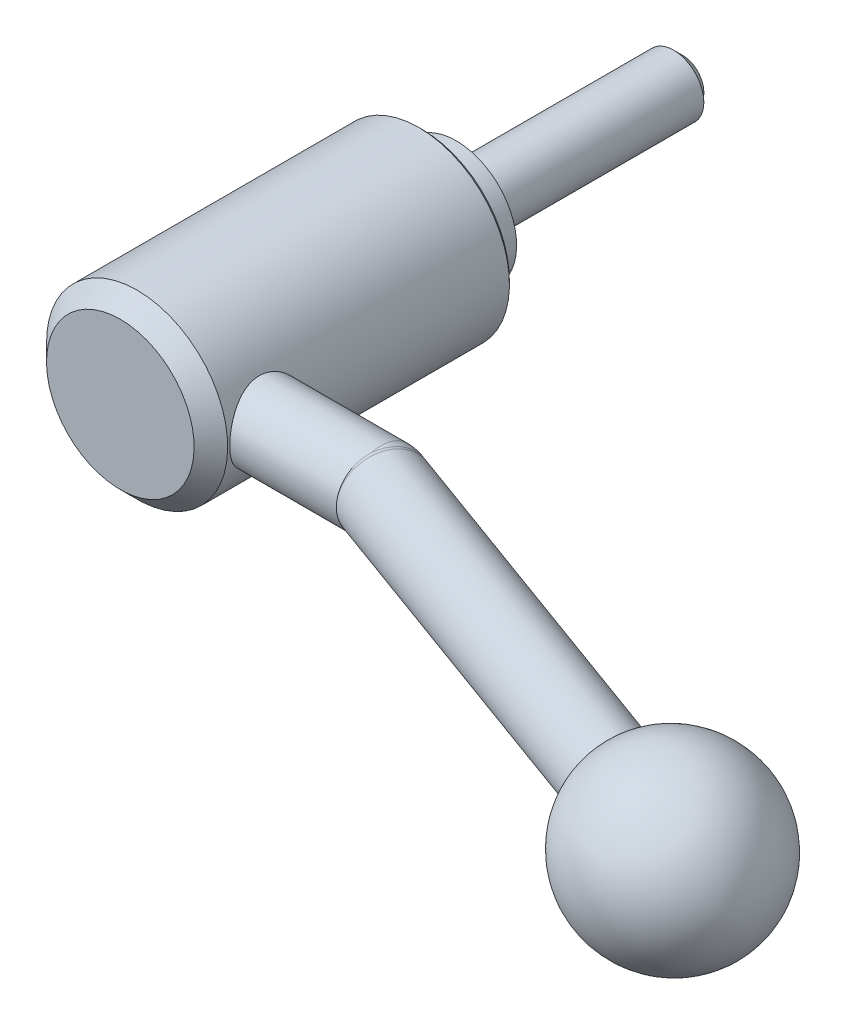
ISO-10303-21;
HEADER;
FILE_DESCRIPTION(('STEP AP214'),'2;1');
FILE_NAME('part.step','',(''),(''),'','','');
FILE_SCHEMA(('AUTOMOTIVE_DESIGN { 1 0 10303 214 1 1 1 1 }'));
ENDSEC;
DATA;
#1=APPLICATION_CONTEXT('core data for automotive mechanical design processes');
#2=APPLICATION_PROTOCOL_DEFINITION('international standard','automotive_design',2000,#1);
#3=PRODUCT_CONTEXT('',#1,'mechanical');
#4=PRODUCT('Part','Part','',(#3));
#5=PRODUCT_RELATED_PRODUCT_CATEGORY('part','',(#4));
#6=PRODUCT_DEFINITION_FORMATION('','',#4);
#7=PRODUCT_DEFINITION_CONTEXT('part definition',#1,'design');
#8=PRODUCT_DEFINITION('design','',#6,#7);
#9=PRODUCT_DEFINITION_SHAPE('','',#8);
#10=(LENGTH_UNIT() NAMED_UNIT(*) SI_UNIT(.MILLI.,.METRE.));
#11=(NAMED_UNIT(*) PLANE_ANGLE_UNIT() SI_UNIT($,.RADIAN.));
#12=(NAMED_UNIT(*) SI_UNIT($,.STERADIAN.) SOLID_ANGLE_UNIT());
#13=UNCERTAINTY_MEASURE_WITH_UNIT(LENGTH_MEASURE(1.E-05),#10,'distance_accuracy_value','');
#14=(GEOMETRIC_REPRESENTATION_CONTEXT(3) GLOBAL_UNCERTAINTY_ASSIGNED_CONTEXT((#13)) GLOBAL_UNIT_ASSIGNED_CONTEXT((#10,
#11,#12)) REPRESENTATION_CONTEXT('',''));
#15=CARTESIAN_POINT('',(0.,0.,0.));
#16=DIRECTION('',(0.,0.,1.));
#17=DIRECTION('',(1.,0.,0.));
#18=AXIS2_PLACEMENT_3D('',#15,#16,#17);
#19=CARTESIAN_POINT('',(0.,0.,-20.));
#20=DIRECTION('',(0.,0.,-1.));
#21=DIRECTION('',(0.,1.,0.));
#22=AXIS2_PLACEMENT_3D('',#19,#20,#21);
#23=CYLINDRICAL_SURFACE('',#22,12.);
#24=CARTESIAN_POINT('',(0.,0.,4.95));
#25=DIRECTION('',(0.,0.,-1.));
#26=DIRECTION('',(0.,1.,0.));
#27=AXIS2_PLACEMENT_3D('',#24,#25,#26);
#28=CIRCLE('',#27,12.);
#29=CARTESIAN_POINT('',(0.,12.,4.95));
#30=VERTEX_POINT('',#29);
#31=EDGE_CURVE('E142',#30,#30,#28,.T.);
#32=ORIENTED_EDGE('',*,*,#31,.F.);
#33=EDGE_LOOP('',(#32));
#34=FACE_BOUND('',#33,.T.);
#35=CARTESIAN_POINT('',(10.9087121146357,5.,37.));
#36=CARTESIAN_POINT('',(10.9087130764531,4.99999907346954,37.1334013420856));
#37=CARTESIAN_POINT('',(10.9111675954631,4.99465346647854,37.266850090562));
#38=CARTESIAN_POINT('',(10.9209052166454,4.97332510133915,37.5327768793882));
#39=CARTESIAN_POINT('',(10.9281914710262,4.95733539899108,37.6652542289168));
#40=CARTESIAN_POINT('',(10.94736464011,4.91485001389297,37.928469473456));
#41=CARTESIAN_POINT('',(10.9592613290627,4.88833200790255,38.0592030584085));
#42=CARTESIAN_POINT('',(10.9872633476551,4.82506361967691,38.3177583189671));
#43=CARTESIAN_POINT('',(11.0033704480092,4.7883089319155,38.4455787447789));
#44=CARTESIAN_POINT('',(11.0391992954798,4.7051161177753,38.6968536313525));
#45=CARTESIAN_POINT('',(11.0589043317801,4.65872262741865,38.8203252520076));
#46=CARTESIAN_POINT('',(11.1013893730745,4.5565572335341,39.062794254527));
#47=CARTESIAN_POINT('',(11.1241705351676,4.5007817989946,39.1817899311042));
#48=CARTESIAN_POINT('',(11.1961478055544,4.3200790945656,39.5308988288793));
#49=CARTESIAN_POINT('',(11.2490254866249,4.18166963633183,39.7534507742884));
#50=CARTESIAN_POINT('',(11.3622340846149,3.86388960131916,40.185337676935));
#51=CARTESIAN_POINT('',(11.4228172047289,3.68264836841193,40.3932181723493));
#52=CARTESIAN_POINT('',(11.5425773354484,3.28805127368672,40.7768129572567));
#53=CARTESIAN_POINT('',(11.6017537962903,3.07468308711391,40.9525148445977));
#54=CARTESIAN_POINT('',(11.6861172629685,2.72939811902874,41.1918033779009));
#55=CARTESIAN_POINT('',(11.7140370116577,2.60726265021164,41.2688525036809));
#56=CARTESIAN_POINT('',(11.7670757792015,2.35633907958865,41.4123143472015));
#57=CARTESIAN_POINT('',(11.7921959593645,2.22755376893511,41.4787314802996));
#58=CARTESIAN_POINT('',(11.838917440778,1.96416180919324,41.6003389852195));
#59=CARTESIAN_POINT('',(11.8605184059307,1.82955460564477,41.6555282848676));
#60=CARTESIAN_POINT('',(11.8995529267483,1.55556138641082,41.7540939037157));
#61=CARTESIAN_POINT('',(11.9169885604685,1.41617779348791,41.7974761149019));
#62=CARTESIAN_POINT('',(11.9463943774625,1.14097065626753,41.8700493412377));
#63=CARTESIAN_POINT('',(11.9586002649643,1.00533485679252,41.8998574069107));
#64=CARTESIAN_POINT('',(11.978450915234,0.731783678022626,41.9481078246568));
#65=CARTESIAN_POINT('',(11.9860977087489,0.593869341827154,41.9665552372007));
#66=CARTESIAN_POINT('',(11.9966178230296,0.316820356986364,41.9918906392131));
#67=CARTESIAN_POINT('',(11.9994918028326,0.177685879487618,41.998780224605));
#68=CARTESIAN_POINT('',(12.0003846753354,-0.100685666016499,42.0009233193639));
#69=CARTESIAN_POINT('',(11.9984037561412,-0.239922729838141,41.9961772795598));
#70=CARTESIAN_POINT('',(11.9899136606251,-0.508875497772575,41.9757519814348));
#71=CARTESIAN_POINT('',(11.9836886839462,-0.638652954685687,41.9607587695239));
#72=CARTESIAN_POINT('',(11.9671679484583,-0.896425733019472,41.9207154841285));
#73=CARTESIAN_POINT('',(11.9568708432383,-1.02442045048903,41.8956620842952));
#74=CARTESIAN_POINT('',(11.9324642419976,-1.27768058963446,41.8357474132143));
#75=CARTESIAN_POINT('',(11.9183560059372,-1.40294689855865,41.8008893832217));
#76=CARTESIAN_POINT('',(11.8866740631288,-1.65000960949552,41.7216867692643));
#77=CARTESIAN_POINT('',(11.8690990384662,-1.77180467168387,41.6773385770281));
#78=CARTESIAN_POINT('',(11.8112061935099,-2.1344060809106,41.5291317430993));
#79=CARTESIAN_POINT('',(11.7660875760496,-2.36878813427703,41.4109765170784));
#80=CARTESIAN_POINT('',(11.6674248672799,-2.81488765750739,41.1406025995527));
#81=CARTESIAN_POINT('',(11.6138778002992,-3.02659707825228,40.9883718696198));
#82=CARTESIAN_POINT('',(11.4992708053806,-3.4373466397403,40.6416848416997));
#83=CARTESIAN_POINT('',(11.4379473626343,-3.6344418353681,40.4450085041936));
#84=CARTESIAN_POINT('',(11.317506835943,-3.9937495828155,40.0211105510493));
#85=CARTESIAN_POINT('',(11.2583906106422,-4.15594867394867,39.7938772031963));
#86=CARTESIAN_POINT('',(11.1754830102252,-4.37204843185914,39.4302315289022));
#87=CARTESIAN_POINT('',(11.1484199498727,-4.44042007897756,39.3029580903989));
#88=CARTESIAN_POINT('',(11.0975376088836,-4.5660982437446,39.0424564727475));
#89=CARTESIAN_POINT('',(11.0737170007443,-4.62340929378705,38.9092307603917));
#90=CARTESIAN_POINT('',(11.0301558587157,-4.72639308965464,38.6377673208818));
#91=CARTESIAN_POINT('',(11.010413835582,-4.77207008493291,38.4995314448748));
#92=CARTESIAN_POINT('',(10.9757324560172,-4.85130620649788,38.219039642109));
#93=CARTESIAN_POINT('',(10.9607926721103,-4.88486641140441,38.0767840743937));
#94=CARTESIAN_POINT('',(10.9370969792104,-4.93768074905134,37.7987576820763));
#95=CARTESIAN_POINT('',(10.9280027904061,-4.95772169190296,37.6631648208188));
#96=CARTESIAN_POINT('',(10.9148523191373,-4.9866073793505,37.3905520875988));
#97=CARTESIAN_POINT('',(10.9107956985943,-4.99545287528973,37.2535323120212));
#98=CARTESIAN_POINT('',(10.9078699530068,-5.00183821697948,36.9792139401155));
#99=CARTESIAN_POINT('',(10.9089993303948,-4.9993813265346,36.8419154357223));
#100=CARTESIAN_POINT('',(10.9163998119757,-4.98320111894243,36.5681288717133));
#101=CARTESIAN_POINT('',(10.9226707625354,-4.96947813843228,36.4316407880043));
#102=CARTESIAN_POINT('',(10.939564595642,-4.93217158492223,36.1692842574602));
#103=CARTESIAN_POINT('',(10.9498816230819,-4.90927900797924,36.0432974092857));
#104=CARTESIAN_POINT('',(10.9744912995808,-4.85401305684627,35.7938045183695));
#105=CARTESIAN_POINT('',(10.9887852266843,-4.82163663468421,35.6702992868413));
#106=CARTESIAN_POINT('',(11.0370194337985,-4.71071065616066,35.3047320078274));
#107=CARTESIAN_POINT('',(11.0763259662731,-4.6183356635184,35.0674195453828));
#108=CARTESIAN_POINT('',(11.1668340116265,-4.39509042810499,34.6014982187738));
#109=CARTESIAN_POINT('',(11.2184687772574,-4.26275559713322,34.3736835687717));
#110=CARTESIAN_POINT('',(11.3271978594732,-3.9648148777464,33.9423843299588));
#111=CARTESIAN_POINT('',(11.3842945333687,-3.79919458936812,33.7389103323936));
#112=CARTESIAN_POINT('',(11.5031524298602,-3.42333828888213,33.344771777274));
#113=CARTESIAN_POINT('',(11.5649149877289,-3.21056780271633,33.1564985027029));
#114=CARTESIAN_POINT('',(11.652539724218,-2.86918502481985,32.9026870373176));
#115=CARTESIAN_POINT('',(11.6809270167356,-2.75160882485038,32.8228101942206));
#116=CARTESIAN_POINT('',(11.7352796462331,-2.50969002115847,32.6731475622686));
#117=CARTESIAN_POINT('',(11.761246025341,-2.38535036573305,32.6033574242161));
#118=CARTESIAN_POINT('',(11.8101156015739,-2.13027929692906,32.4742500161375));
#119=CARTESIAN_POINT('',(11.8330091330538,-1.99952940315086,32.4149656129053));
#120=CARTESIAN_POINT('',(11.8749794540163,-1.73293321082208,32.3077113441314));
#121=CARTESIAN_POINT('',(11.8940578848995,-1.59708913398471,32.2597366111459));
#122=CARTESIAN_POINT('',(11.9278439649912,-1.32129951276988,32.1755883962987));
#123=CARTESIAN_POINT('',(11.9425527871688,-1.18135508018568,32.1394117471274));
#124=CARTESIAN_POINT('',(11.9671605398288,-0.89845467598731,32.0792595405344));
#125=CARTESIAN_POINT('',(11.9770598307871,-0.75549893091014,32.0552830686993));
#126=CARTESIAN_POINT('',(11.9912289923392,-0.477883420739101,32.021064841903));
#127=CARTESIAN_POINT('',(11.9958449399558,-0.343344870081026,32.0099778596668));
#128=CARTESIAN_POINT('',(12.0005316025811,-0.073683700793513,31.9987215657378));
#129=CARTESIAN_POINT('',(12.0006007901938,0.0614390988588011,31.9985559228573));
#130=CARTESIAN_POINT('',(11.9961887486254,0.331106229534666,32.0091516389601));
#131=CARTESIAN_POINT('',(11.9917099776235,0.465650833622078,32.0199070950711));
#132=CARTESIAN_POINT('',(11.9783256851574,0.733261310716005,32.0522225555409));
#133=CARTESIAN_POINT('',(11.9694185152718,0.866326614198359,32.0737865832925));
#134=CARTESIAN_POINT('',(11.9478093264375,1.12521434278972,32.1265303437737));
#135=CARTESIAN_POINT('',(11.9352551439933,1.25112522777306,32.1573367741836));
#136=CARTESIAN_POINT('',(11.9065633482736,1.49981842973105,32.2284909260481));
#137=CARTESIAN_POINT('',(11.8904244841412,1.62259963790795,32.2688419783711));
#138=CARTESIAN_POINT('',(11.8371898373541,1.98503132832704,32.403699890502));
#139=CARTESIAN_POINT('',(11.7952573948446,2.21898154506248,32.5120551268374));
#140=CARTESIAN_POINT('',(11.700229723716,2.67613896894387,32.7679713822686));
#141=CARTESIAN_POINT('',(11.6467156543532,2.8983828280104,32.9170829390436));
#142=CARTESIAN_POINT('',(11.5348651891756,3.31565850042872,33.248014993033));
#143=CARTESIAN_POINT('',(11.4765270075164,3.51068016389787,33.4298476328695));
#144=CARTESIAN_POINT('',(11.3565857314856,3.88182487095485,33.835823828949));
#145=CARTESIAN_POINT('',(11.2950305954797,4.05575892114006,34.0620045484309));
#146=CARTESIAN_POINT('',(11.2086213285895,4.28644220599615,34.4218577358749));
#147=CARTESIAN_POINT('',(11.1807840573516,4.35834922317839,34.5453544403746));
#148=CARTESIAN_POINT('',(11.1279493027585,4.49153302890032,34.7985115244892));
#149=CARTESIAN_POINT('',(11.1029505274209,4.55281466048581,34.9281690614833));
#150=CARTESIAN_POINT('',(11.0567342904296,4.66392927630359,35.1921877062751));
#151=CARTESIAN_POINT('',(11.0354990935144,4.7138162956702,35.3265229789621));
#152=CARTESIAN_POINT('',(10.9974167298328,4.80199267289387,35.599492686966));
#153=CARTESIAN_POINT('',(10.9805674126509,4.84028771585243,35.7381249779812));
#154=CARTESIAN_POINT('',(10.9519122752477,4.90477948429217,36.0182918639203));
#155=CARTESIAN_POINT('',(10.9400931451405,4.93100815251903,36.1598177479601));
#156=CARTESIAN_POINT('',(10.9219030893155,4.97116941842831,36.4448760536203));
#157=CARTESIAN_POINT('',(10.9155279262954,4.98511157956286,36.5884068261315));
#158=CARTESIAN_POINT('',(10.9109028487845,4.99521783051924,36.7768518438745));
#159=CARTESIAN_POINT('',(10.9100818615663,4.99701063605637,36.8214567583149));
#160=CARTESIAN_POINT('',(10.9089863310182,4.99940188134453,36.9107060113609));
#161=CARTESIAN_POINT('',(10.9087117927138,5.00000031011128,36.9553503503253));
#162=CARTESIAN_POINT('',(10.9087121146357,5.,37.));
#163=B_SPLINE_CURVE_WITH_KNOTS('',3,(#35,#36,#37,#38,#39,#40,#41,#42,#43,#44,#45,#46,#47,#48,
#49,#50,#51,#52,#53,#54,#55,#56,#57,#58,#59,#60,#61,#62,#63,#64,#65,#66,#67,#68,#69,#70,#71,#72,
#73,#74,#75,#76,#77,#78,#79,#80,#81,#82,#83,#84,#85,#86,#87,#88,#89,#90,#91,#92,#93,#94,#95,#96,
#97,#98,#99,#100,#101,#102,#103,#104,#105,#106,#107,#108,#109,#110,#111,#112,#113,#114,#115,
#116,#117,#118,#119,#120,#121,#122,#123,#124,#125,#126,#127,#128,#129,#130,#131,#132,#133,#134,
#135,#136,#137,#138,#139,#140,#141,#142,#143,#144,#145,#146,#147,#148,#149,#150,#151,#152,#153,
#154,#155,#156,#157,#158,#159,#160,#161,#162),.UNSPECIFIED.,.T.,.F.,(4,2,2,2,2,2,2,2,2,2,2,2,2,
2,2,2,2,2,2,2,2,2,2,2,2,2,2,2,2,2,2,2,2,2,2,2,2,2,2,2,2,2,2,2,2,2,2,2,2,2,2,2,2,2,2,2,2,2,2,2,2,
2,2,4),(0.,0.400157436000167,0.800576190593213,1.20184852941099,1.60328989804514,
2.00291210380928,2.40268505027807,3.20123019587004,4.04483609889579,4.88876646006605,
5.32954710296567,5.77014421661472,6.21078338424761,6.65120225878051,7.06888225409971,
7.48637606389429,7.90381222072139,8.32123220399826,8.71313663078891,9.10517074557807,
9.49707541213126,9.88912935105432,10.6843842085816,11.4799204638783,12.3315328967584,
13.1834732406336,13.6239634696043,14.064272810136,14.5044210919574,14.9445301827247,
15.3560893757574,15.7676209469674,16.1790336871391,16.5904341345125,16.9753736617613,
17.3604370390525,18.129966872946,18.9320860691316,19.7345530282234,20.6023475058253,
21.0367677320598,21.4710000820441,21.9065678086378,22.3419477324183,22.7772106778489,
23.2124409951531,23.6171514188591,24.0219977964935,24.4266254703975,24.8314038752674,
25.2216396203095,25.6120117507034,26.3921129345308,27.2074696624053,28.0231295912,
28.8942922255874,29.3306260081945,29.7667603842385,30.2007814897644,30.6345893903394,
31.067242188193,31.4995579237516,31.6334900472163,31.7674234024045),.UNSPECIFIED.);
#164=CARTESIAN_POINT('',(10.9087121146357,5.,37.));
#165=VERTEX_POINT('',#164);
#166=EDGE_CURVE('E76',#165,#165,#163,.T.);
#167=ORIENTED_EDGE('',*,*,#166,.F.);
#168=EDGE_LOOP('',(#167));
#169=FACE_BOUND('',#168,.T.);
#170=CARTESIAN_POINT('',(0.,0.,42.275));
#171=DIRECTION('',(0.,0.,-1.));
#172=DIRECTION('',(0.,1.,0.));
#173=AXIS2_PLACEMENT_3D('',#170,#171,#172);
#174=CIRCLE('',#173,12.);
#175=CARTESIAN_POINT('',(0.,12.,42.275));
#176=VERTEX_POINT('',#175);
#177=EDGE_CURVE('E144',#176,#176,#174,.T.);
#178=ORIENTED_EDGE('',*,*,#177,.T.);
#179=EDGE_LOOP('',(#178));
#180=FACE_BOUND('',#179,.T.);
#181=ADVANCED_FACE('F14',(#34,#169,#180),#23,.T.);
#182=CARTESIAN_POINT('',(0.,0.,44.5));
#183=DIRECTION('',(0.,0.,-1.));
#184=DIRECTION('',(0.,1.,0.));
#185=AXIS2_PLACEMENT_3D('',#182,#183,#184);
#186=PLANE('',#185);
#187=CARTESIAN_POINT('',(0.,0.,44.5));
#188=DIRECTION('',(0.,0.,-1.));
#189=DIRECTION('',(0.,1.,0.));
#190=AXIS2_PLACEMENT_3D('',#187,#188,#189);
#191=CIRCLE('',#190,9.775);
#192=CARTESIAN_POINT('',(0.,9.775,44.5));
#193=VERTEX_POINT('',#192);
#194=EDGE_CURVE('E84',#193,#193,#191,.T.);
#195=ORIENTED_EDGE('',*,*,#194,.F.);
#196=EDGE_LOOP('',(#195));
#197=FACE_BOUND('',#196,.T.);
#198=ADVANCED_FACE('F60',(#197),#186,.F.);
#199=CARTESIAN_POINT('',(0.,0.,44.5));
#200=DIRECTION('',(0.,0.,-1.));
#201=DIRECTION('',(0.,1.,0.));
#202=AXIS2_PLACEMENT_3D('',#199,#200,#201);
#203=CONICAL_SURFACE('',#202,9.775,0.785398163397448);
#204=ORIENTED_EDGE('',*,*,#177,.F.);
#205=EDGE_LOOP('',(#204));
#206=FACE_BOUND('',#205,.T.);
#207=ORIENTED_EDGE('',*,*,#194,.T.);
#208=EDGE_LOOP('',(#207));
#209=FACE_BOUND('',#208,.T.);
#210=ADVANCED_FACE('F66',(#206,#209),#203,.T.);
#211=CARTESIAN_POINT('',(0.,0.,4.95));
#212=DIRECTION('',(0.,0.,1.));
#213=DIRECTION('',(0.,-1.,0.));
#214=AXIS2_PLACEMENT_3D('',#211,#212,#213);
#215=CONICAL_SURFACE('',#214,12.,0.785398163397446);
#216=CARTESIAN_POINT('',(0.,0.,4.5));
#217=DIRECTION('',(0.,0.,-1.));
#218=DIRECTION('',(0.,1.,0.));
#219=AXIS2_PLACEMENT_3D('',#216,#217,#218);
#220=CIRCLE('',#219,11.55);
#221=CARTESIAN_POINT('',(0.,11.55,4.5));
#222=VERTEX_POINT('',#221);
#223=EDGE_CURVE('E139',#222,#222,#220,.T.);
#224=ORIENTED_EDGE('',*,*,#223,.F.);
#225=EDGE_LOOP('',(#224));
#226=FACE_BOUND('',#225,.T.);
#227=ORIENTED_EDGE('',*,*,#31,.T.);
#228=EDGE_LOOP('',(#227));
#229=FACE_BOUND('',#228,.T.);
#230=ADVANCED_FACE('F73',(#226,#229),#215,.T.);
#231=CARTESIAN_POINT('',(11.55,0.,4.5));
#232=DIRECTION('',(0.,0.,1.));
#233=DIRECTION('',(0.,-1.,0.));
#234=AXIS2_PLACEMENT_3D('',#231,#232,#233);
#235=PLANE('',#234);
#236=CARTESIAN_POINT('',(0.,0.,4.5));
#237=DIRECTION('',(0.,0.,-1.));
#238=DIRECTION('',(0.,1.,0.));
#239=AXIS2_PLACEMENT_3D('',#236,#237,#238);
#240=CIRCLE('',#239,8.);
#241=CARTESIAN_POINT('',(0.,8.,4.5));
#242=VERTEX_POINT('',#241);
#243=EDGE_CURVE('E134',#242,#242,#240,.T.);
#244=ORIENTED_EDGE('',*,*,#243,.F.);
#245=EDGE_LOOP('',(#244));
#246=FACE_BOUND('',#245,.T.);
#247=ORIENTED_EDGE('',*,*,#223,.T.);
#248=EDGE_LOOP('',(#247));
#249=FACE_BOUND('',#248,.T.);
#250=ADVANCED_FACE('F156',(#246,#249),#235,.F.);
#251=CARTESIAN_POINT('',(0.,0.,-20.));
#252=DIRECTION('',(0.,0.,-1.));
#253=DIRECTION('',(0.,1.,0.));
#254=AXIS2_PLACEMENT_3D('',#251,#252,#253);
#255=CYLINDRICAL_SURFACE('',#254,8.);
#256=CARTESIAN_POINT('',(0.,0.,0.));
#257=DIRECTION('',(0.,0.,-1.));
#258=DIRECTION('',(0.,1.,0.));
#259=AXIS2_PLACEMENT_3D('',#256,#257,#258);
#260=CIRCLE('',#259,8.);
#261=CARTESIAN_POINT('',(0.,8.,0.));
#262=VERTEX_POINT('',#261);
#263=EDGE_CURVE('E130',#262,#262,#260,.T.);
#264=ORIENTED_EDGE('',*,*,#263,.F.);
#265=EDGE_LOOP('',(#264));
#266=FACE_BOUND('',#265,.T.);
#267=ORIENTED_EDGE('',*,*,#243,.T.);
#268=EDGE_LOOP('',(#267));
#269=FACE_BOUND('',#268,.T.);
#270=ADVANCED_FACE('F161',(#266,#269),#255,.T.);
#271=CARTESIAN_POINT('',(8.,0.,0.));
#272=DIRECTION('',(0.,0.,1.));
#273=DIRECTION('',(0.,-1.,0.));
#274=AXIS2_PLACEMENT_3D('',#271,#272,#273);
#275=PLANE('',#274);
#276=CARTESIAN_POINT('',(0.,0.,0.));
#277=DIRECTION('',(0.,0.,-1.));
#278=DIRECTION('',(0.,1.,0.));
#279=AXIS2_PLACEMENT_3D('',#276,#277,#278);
#280=CIRCLE('',#279,4.);
#281=CARTESIAN_POINT('',(0.,4.,0.));
#282=VERTEX_POINT('',#281);
#283=EDGE_CURVE('E128',#282,#282,#280,.T.);
#284=ORIENTED_EDGE('',*,*,#283,.F.);
#285=EDGE_LOOP('',(#284));
#286=FACE_BOUND('',#285,.T.);
#287=ORIENTED_EDGE('',*,*,#263,.T.);
#288=EDGE_LOOP('',(#287));
#289=FACE_BOUND('',#288,.T.);
#290=ADVANCED_FACE('F169',(#286,#289),#275,.F.);
#291=CARTESIAN_POINT('',(0.,0.,-20.));
#292=DIRECTION('',(0.,0.,-1.));
#293=DIRECTION('',(0.,1.,0.));
#294=AXIS2_PLACEMENT_3D('',#291,#292,#293);
#295=CYLINDRICAL_SURFACE('',#294,4.);
#296=CARTESIAN_POINT('',(0.,0.,-28.8));
#297=DIRECTION('',(0.,0.,-1.));
#298=DIRECTION('',(0.,1.,0.));
#299=AXIS2_PLACEMENT_3D('',#296,#297,#298);
#300=CIRCLE('',#299,4.);
#301=CARTESIAN_POINT('',(0.,4.,-28.8));
#302=VERTEX_POINT('',#301);
#303=EDGE_CURVE('E9',#302,#302,#300,.F.);
#304=ORIENTED_EDGE('',*,*,#303,.T.);
#305=EDGE_LOOP('',(#304));
#306=FACE_BOUND('',#305,.T.);
#307=ORIENTED_EDGE('',*,*,#283,.T.);
#308=EDGE_LOOP('',(#307));
#309=FACE_BOUND('',#308,.T.);
#310=ADVANCED_FACE('F92',(#306,#309),#295,.T.);
#311=CARTESIAN_POINT('',(32.,0.,37.));
#312=DIRECTION('',(1.,0.,0.));
#313=DIRECTION('',(0.,1.,0.));
#314=AXIS2_PLACEMENT_3D('',#311,#312,#313);
#315=CYLINDRICAL_SURFACE('',#314,5.);
#316=CARTESIAN_POINT('',(27.0002,-4.83117434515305,38.2883145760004));
#317=CARTESIAN_POINT('',(26.9771151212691,-4.81425533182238,38.3517716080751));
#318=CARTESIAN_POINT('',(26.9549711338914,-4.79599919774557,38.4151983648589));
#319=CARTESIAN_POINT('',(26.9123130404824,-4.75682023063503,38.5417664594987));
#320=CARTESIAN_POINT('',(26.8917987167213,-4.73589775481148,38.6049078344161));
#321=CARTESIAN_POINT('',(26.8323357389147,-4.66915958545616,38.7935221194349));
#322=CARTESIAN_POINT('',(26.7954419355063,-4.61935429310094,38.9182563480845));
#323=CARTESIAN_POINT('',(26.7260075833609,-4.50939025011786,39.1641477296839));
#324=CARTESIAN_POINT('',(26.69346300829,-4.4492411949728,39.2853081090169));
#325=CARTESIAN_POINT('',(26.631969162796,-4.3188661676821,39.5230484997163));
#326=CARTESIAN_POINT('',(26.6030201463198,-4.2486394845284,39.6396281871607));
#327=CARTESIAN_POINT('',(26.5482810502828,-4.09859694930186,39.8670626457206));
#328=CARTESIAN_POINT('',(26.5224880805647,-4.01879000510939,39.9779226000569));
#329=CARTESIAN_POINT('',(26.4737060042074,-3.85000176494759,40.1931483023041));
#330=CARTESIAN_POINT('',(26.4507179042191,-3.76101719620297,40.2975117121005));
#331=CARTESIAN_POINT('',(26.4073462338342,-3.57452106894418,40.4988018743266));
#332=CARTESIAN_POINT('',(26.3869613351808,-3.47701390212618,40.595732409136));
#333=CARTESIAN_POINT('',(26.3486169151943,-3.27404367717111,40.7814771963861));
#334=CARTESIAN_POINT('',(26.330658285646,-3.16857771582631,40.8702884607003));
#335=CARTESIAN_POINT('',(26.2968878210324,-2.94931894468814,41.0399164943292));
#336=CARTESIAN_POINT('',(26.2810998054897,-2.83545204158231,41.1206422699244));
#337=CARTESIAN_POINT('',(26.2517972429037,-2.60111411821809,41.2724351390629));
#338=CARTESIAN_POINT('',(26.2382835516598,-2.48064063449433,41.3434985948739));
#339=CARTESIAN_POINT('',(26.2134747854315,-2.23400638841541,41.4753507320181));
#340=CARTESIAN_POINT('',(26.2021792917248,-2.10784670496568,41.5361413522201));
#341=CARTESIAN_POINT('',(26.1817528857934,-1.850678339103,41.6469996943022));
#342=CARTESIAN_POINT('',(26.1726227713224,-1.71966789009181,41.6970634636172));
#343=CARTESIAN_POINT('',(26.1565659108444,-1.45489437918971,41.7856658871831));
#344=CARTESIAN_POINT('',(26.1496212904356,-1.32116370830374,41.8242978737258));
#345=CARTESIAN_POINT('',(26.1378073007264,-1.05084556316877,41.8903082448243));
#346=CARTESIAN_POINT('',(26.1329387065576,-0.914257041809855,41.9176824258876));
#347=CARTESIAN_POINT('',(26.121432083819,-0.501829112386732,41.9825129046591));
#348=CARTESIAN_POINT('',(26.1178737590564,-0.223000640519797,42.0027862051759));
#349=CARTESIAN_POINT('',(26.1189625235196,0.332703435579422,41.9966121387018));
#350=CARTESIAN_POINT('',(26.1235681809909,0.609581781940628,41.9704006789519));
#351=CARTESIAN_POINT('',(26.1365918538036,1.01839236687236,41.8971560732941));
#352=CARTESIAN_POINT('',(26.1419571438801,1.15365429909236,41.8670594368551));
#353=CARTESIAN_POINT('',(26.1547482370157,1.42110904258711,41.7957866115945));
#354=CARTESIAN_POINT('',(26.162173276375,1.55330297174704,41.7546145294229));
#355=CARTESIAN_POINT('',(26.1791117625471,1.81374291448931,41.661488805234));
#356=CARTESIAN_POINT('',(26.1886259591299,1.94198749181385,41.6095312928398));
#357=CARTESIAN_POINT('',(26.2097731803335,2.19354456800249,41.4952682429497));
#358=CARTESIAN_POINT('',(26.2214054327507,2.3168588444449,41.4329664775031));
#359=CARTESIAN_POINT('',(26.2468425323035,2.55777038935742,41.2984703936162));
#360=CARTESIAN_POINT('',(26.2606478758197,2.67536634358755,41.2262738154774));
#361=CARTESIAN_POINT('',(26.2904898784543,2.90395912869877,41.0725891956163));
#362=CARTESIAN_POINT('',(26.3065257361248,3.01495830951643,40.991104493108));
#363=CARTESIAN_POINT('',(26.3410146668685,3.23022663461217,40.8189957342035));
#364=CARTESIAN_POINT('',(26.3594803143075,3.33445623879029,40.7283247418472));
#365=CARTESIAN_POINT('',(26.3988776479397,3.53478388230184,40.5389677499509));
#366=CARTESIAN_POINT('',(26.4198084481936,3.63088482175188,40.440284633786));
#367=CARTESIAN_POINT('',(26.4643216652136,3.81440211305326,40.2356199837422));
#368=CARTESIAN_POINT('',(26.4879053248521,3.90181435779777,40.1296350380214));
#369=CARTESIAN_POINT('',(26.5379464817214,4.06730764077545,39.9113164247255));
#370=CARTESIAN_POINT('',(26.564402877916,4.14539223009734,39.7989851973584));
#371=CARTESIAN_POINT('',(26.6190846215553,4.28799916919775,39.5748364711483));
#372=CARTESIAN_POINT('',(26.6471479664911,4.35301377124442,39.463292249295));
#373=CARTESIAN_POINT('',(26.7066083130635,4.47390595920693,39.2362277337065));
#374=CARTESIAN_POINT('',(26.7380049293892,4.52978459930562,39.1207079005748));
#375=CARTESIAN_POINT('',(26.8047544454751,4.63216753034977,38.8866145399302));
#376=CARTESIAN_POINT('',(26.8401091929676,4.67866741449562,38.7680396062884));
#377=CARTESIAN_POINT('',(26.915981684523,4.76212497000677,38.529146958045));
#378=CARTESIAN_POINT('',(26.9565014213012,4.79907894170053,38.4088285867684));
#379=CARTESIAN_POINT('',(27.000199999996,4.8311743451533,38.2883145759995));
#380=B_SPLINE_CURVE_WITH_KNOTS('',3,(#316,#317,#318,#319,#320,#321,#322,#323,#324,#325,#326,
#327,#328,#329,#330,#331,#332,#333,#334,#335,#336,#337,#338,#339,#340,#341,#342,#343,#344,#345,
#346,#347,#348,#349,#350,#351,#352,#353,#354,#355,#356,#357,#358,#359,#360,#361,#362,#363,#364,
#365,#366,#367,#368,#369,#370,#371,#372,#373,#374,#375,#376,#377,#378,#379),.UNSPECIFIED.,.F.,
.F.,(4,2,2,2,2,2,2,2,2,2,2,2,2,2,2,2,2,2,2,2,2,2,2,2,2,2,2,2,2,2,2,4),(0.,0.208793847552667,
0.417559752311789,0.834859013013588,1.25176923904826,1.66870889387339,2.08526383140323,
2.50196783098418,2.91845835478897,3.33510154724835,3.75600341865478,4.17706331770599,
4.5980436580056,5.01917885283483,5.43677439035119,5.85452571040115,6.68900674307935,
7.51926494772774,7.93487433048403,8.35032982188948,8.76593465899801,9.18138827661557,
9.59693693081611,10.0123366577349,10.4299775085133,10.8474687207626,11.2651563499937,
11.6826844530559,12.078641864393,12.4745535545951,12.870650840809,13.2669014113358),.UNSPECIFIED.);
#381=CARTESIAN_POINT('',(27.,-4.83102779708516,38.2888640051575));
#382=VERTEX_POINT('',#381);
#383=CARTESIAN_POINT('',(26.1183650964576,0.,42.));
#384=VERTEX_POINT('',#383);
#385=EDGE_CURVE('E29',#382,#384,#380,.T.);
#386=ORIENTED_EDGE('',*,*,#385,.T.);
#387=CARTESIAN_POINT('',(27.,4.83102779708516,38.2888640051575));
#388=VERTEX_POINT('',#387);
#389=EDGE_CURVE('E97',#384,#388,#380,.T.);
#390=ORIENTED_EDGE('',*,*,#389,.T.);
#391=CARTESIAN_POINT('',(27.,0.,37.));
#392=DIRECTION('',(1.,0.,0.));
#393=DIRECTION('',(0.,1.,0.));
#394=AXIS2_PLACEMENT_3D('',#391,#392,#393);
#395=CIRCLE('',#394,5.);
#396=EDGE_CURVE('E106',#382,#388,#395,.T.);
#397=ORIENTED_EDGE('',*,*,#396,.F.);
#398=EDGE_LOOP('',(#386,#390,#397));
#399=FACE_BOUND('',#398,.T.);
#400=ORIENTED_EDGE('',*,*,#166,.T.);
#401=EDGE_LOOP('',(#400));
#402=FACE_BOUND('',#401,.T.);
#403=ADVANCED_FACE('F86',(#399,#402),#315,.T.);
#404=CARTESIAN_POINT('',(27.,0.,37.));
#405=DIRECTION('',(1.,0.,0.));
#406=DIRECTION('',(0.,0.,1.));
#407=AXIS2_PLACEMENT_3D('',#404,#405,#406);
#408=SPHERICAL_SURFACE('',#407,5.);
#409=CARTESIAN_POINT('',(27.4142329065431,0.,37.1507684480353));
#410=DIRECTION('',(0.939692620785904,0.,0.342020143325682));
#411=DIRECTION('',(-0.342020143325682,0.,0.939692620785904));
#412=AXIS2_PLACEMENT_3D('',#409,#410,#411);
#413=CIRCLE('',#412,4.98053008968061);
#414=EDGE_CURVE('E36',#382,#388,#413,.T.);
#415=ORIENTED_EDGE('',*,*,#414,.F.);
#416=ORIENTED_EDGE('',*,*,#396,.T.);
#417=EDGE_LOOP('',(#415,#416));
#418=FACE_BOUND('',#417,.T.);
#419=ADVANCED_FACE('F91',(#418),#408,.T.);
#420=CARTESIAN_POINT('',(27.828465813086,0.,37.3015368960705));
#421=DIRECTION('',(0.939692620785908,0.,0.342020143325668));
#422=DIRECTION('',(-0.342020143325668,0.,0.939692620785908));
#423=AXIS2_PLACEMENT_3D('',#420,#421,#422);
#424=SPHERICAL_SURFACE('',#423,5.);
#425=ORIENTED_EDGE('',*,*,#385,.F.);
#426=ORIENTED_EDGE('',*,*,#414,.T.);
#427=ORIENTED_EDGE('',*,*,#389,.F.);
#428=CARTESIAN_POINT('',(27.8284658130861,0.,37.3015368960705));
#429=DIRECTION('',(0.939692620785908,0.,0.342020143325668));
#430=DIRECTION('',(-0.342020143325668,0.,0.939692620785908));
#431=AXIS2_PLACEMENT_3D('',#428,#429,#430);
#432=CIRCLE('',#431,5.);
#433=EDGE_CURVE('E104',#384,#384,#432,.T.);
#434=ORIENTED_EDGE('',*,*,#433,.F.);
#435=EDGE_LOOP('',(#425,#426,#427,#434));
#436=FACE_BOUND('',#435,.T.);
#437=ADVANCED_FACE('F108',(#436),#424,.T.);
#438=CARTESIAN_POINT('',(99.5041035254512,0.,63.3893355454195));
#439=DIRECTION('',(0.939692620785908,0.,0.342020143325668));
#440=DIRECTION('',(-0.342020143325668,0.,0.939692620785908));
#441=AXIS2_PLACEMENT_3D('',#438,#439,#440);
#442=CYLINDRICAL_SURFACE('',#441,5.);
#443=CARTESIAN_POINT('',(78.3773961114,0.,55.6998428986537));
#444=DIRECTION('',(0.939692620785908,0.,0.342020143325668));
#445=DIRECTION('',(-0.342020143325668,0.,0.939692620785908));
#446=AXIS2_PLACEMENT_3D('',#443,#444,#445);
#447=CIRCLE('',#446,5.);
#448=CARTESIAN_POINT('',(76.6672953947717,0.,60.3983060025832));
#449=VERTEX_POINT('',#448);
#450=EDGE_CURVE('E120',#449,#449,#447,.T.);
#451=ORIENTED_EDGE('',*,*,#450,.F.);
#452=EDGE_LOOP('',(#451));
#453=FACE_BOUND('',#452,.T.);
#454=ORIENTED_EDGE('',*,*,#433,.T.);
#455=EDGE_LOOP('',(#454));
#456=FACE_BOUND('',#455,.T.);
#457=ADVANCED_FACE('F55',(#453,#456),#442,.T.);
#458=CARTESIAN_POINT('',(76.6672953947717,0.,60.3983060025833));
#459=DIRECTION('',(0.939692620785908,0.,0.342020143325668));
#460=DIRECTION('',(-0.342020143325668,0.,0.939692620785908));
#461=AXIS2_PLACEMENT_3D('',#458,#459,#460);
#462=PLANE('',#461);
#463=CARTESIAN_POINT('',(78.3773961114,0.,55.6998428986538));
#464=DIRECTION('',(0.939692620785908,0.,0.342020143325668));
#465=DIRECTION('',(-0.342020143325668,0.,0.939692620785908));
#466=AXIS2_PLACEMENT_3D('',#463,#464,#465);
#467=CIRCLE('',#466,6.84016260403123);
#468=CARTESIAN_POINT('',(76.0379227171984,0.,62.1274932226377));
#469=VERTEX_POINT('',#468);
#470=EDGE_CURVE('E123',#469,#469,#467,.T.);
#471=ORIENTED_EDGE('',*,*,#470,.F.);
#472=EDGE_LOOP('',(#471));
#473=FACE_BOUND('',#472,.T.);
#474=ORIENTED_EDGE('',*,*,#450,.T.);
#475=EDGE_LOOP('',(#474));
#476=FACE_BOUND('',#475,.T.);
#477=ADVANCED_FACE('F45',(#473,#476),#462,.F.);
#478=CARTESIAN_POINT('',(88.,0.,58.5));
#479=DIRECTION('',(0.,0.999999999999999,0.));
#480=DIRECTION('',(-0.342020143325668,0.,0.939692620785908));
#481=AXIS2_PLACEMENT_3D('',#478,#479,#480);
#482=CIRCLE('',#481,12.5);
#483=TRIMMED_CURVE('',#482,(PARAMETER_VALUE(-1.51798478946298)),
(PARAMETER_VALUE(1.51798478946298)),.T.,.PARAMETER.);
#484=CARTESIAN_POINT('',(87.7743223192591,0.,59.1200443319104));
#485=DIRECTION('',(0.939692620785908,0.,0.342020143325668));
#486=AXIS1_PLACEMENT('',#484,#485);
#487=SURFACE_OF_REVOLUTION('',#483,#486);
#488=ORIENTED_EDGE('',*,*,#470,.T.);
#489=EDGE_LOOP('',(#488));
#490=FACE_BOUND('',#489,.T.);
#491=CARTESIAN_POINT('',(99.5041035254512,0.,63.3893355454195));
#492=VERTEX_POINT('',#491);
#493=VERTEX_LOOP('',#492);
#494=FACE_BOUND('',#493,.T.);
#495=ADVANCED_FACE('F42',(#490,#494),#487,.T.);
#496=CARTESIAN_POINT('',(0.,0.,-30.));
#497=DIRECTION('',(0.,0.,-1.));
#498=DIRECTION('',(0.,1.,0.));
#499=AXIS2_PLACEMENT_3D('',#496,#497,#498);
#500=PLANE('',#499);
#501=CARTESIAN_POINT('',(0.,0.,-30.));
#502=DIRECTION('',(0.,0.,-1.));
#503=DIRECTION('',(0.,1.,0.));
#504=AXIS2_PLACEMENT_3D('',#501,#502,#503);
#505=CIRCLE('',#504,2.8);
#506=CARTESIAN_POINT('',(0.,2.8,-30.));
#507=VERTEX_POINT('',#506);
#508=EDGE_CURVE('E22',#507,#507,#505,.T.);
#509=ORIENTED_EDGE('',*,*,#508,.T.);
#510=EDGE_LOOP('',(#509));
#511=FACE_BOUND('',#510,.T.);
#512=ADVANCED_FACE('F44',(#511),#500,.T.);
#513=CARTESIAN_POINT('',(0.,0.,-30.));
#514=DIRECTION('',(0.,0.,1.));
#515=DIRECTION('',(0.,-1.,0.));
#516=AXIS2_PLACEMENT_3D('',#513,#514,#515);
#517=CONICAL_SURFACE('',#516,2.8,0.785398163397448);
#518=ORIENTED_EDGE('',*,*,#303,.F.);
#519=EDGE_LOOP('',(#518));
#520=FACE_BOUND('',#519,.T.);
#521=ORIENTED_EDGE('',*,*,#508,.F.);
#522=EDGE_LOOP('',(#521));
#523=FACE_BOUND('',#522,.T.);
#524=ADVANCED_FACE('F16',(#520,#523),#517,.T.);
#525=CLOSED_SHELL('',(#181,#198,#210,#230,#250,#270,#290,#310,#403,#419,#437,#457,#477,#495,
#512,#524));
#526=MANIFOLD_SOLID_BREP('B1',#525);
#527=ADVANCED_BREP_SHAPE_REPRESENTATION('',(#18,#526),#14);
#528=SHAPE_DEFINITION_REPRESENTATION(#9,#527);
ENDSEC;
END-ISO-10303-21;
